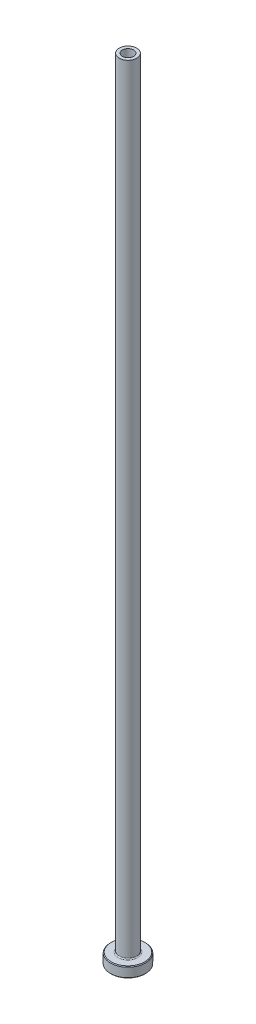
from build123d import *

# Parameters (mm, degrees)
FILLET1_R     = 0.3
CHAMFER1_SIZE = 0.2
CHAMFER3_SIZE = 0.5


with BuildPart() as part:
    # Sketch1 → Revolve1 (revolve)
    with BuildSketch(Plane.XY, mode=Mode.PRIVATE) as revolve1_sk:
        Polygon((-1.6, 225), (-2.5, 225), (-2.5, 3), (-5, 3), (-5, 0), (-1.85, 0), (-1.85, 168), (-1.6, 180), align=None)
    revolve(revolve1_sk.sketch.rotate(Axis((0, 92.187680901, 0), (0, -1, 0)), 270), axis=Axis((0, 92.187680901, 0), (0, -1, 0)))

    # Fillet1
    fillet1_edges = [part.edges().sort_by_distance(p)[0] for p in [
        (0, 3, -2.5),
    ]]
    fillet(fillet1_edges, radius=FILLET1_R)

    # Chamfer1
    chamfer1_edges = [part.edges().sort_by_distance(p)[0] for p in [
        (0, 0, -5),
        (0, 3, -5),
    ]]
    chamfer(chamfer1_edges, length=CHAMFER1_SIZE)

    # Chamfer3
    chamfer3_edges = [part.edges().sort_by_distance(p)[0] for p in [
        (0, 0, -1.85),
    ]]
    chamfer(chamfer3_edges, length=CHAMFER3_SIZE)


solid = part.part
